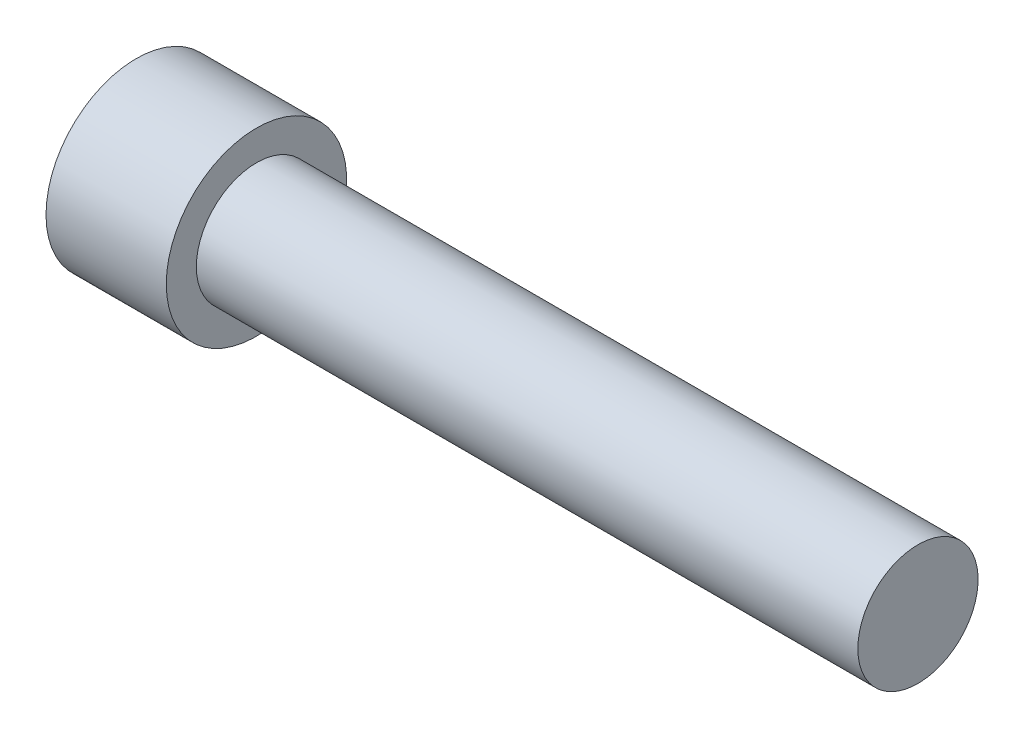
from build123d import *

# Parameters (mm, degrees)
CUT_EXTRUDE1_DEPTH = 3


with BuildPart() as part:
    # Sketch1 → Revolve1 (revolve)
    with BuildSketch(Plane.XY, mode=Mode.PRIVATE) as revolve1_sk:
        Polygon((-31.683838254, -2), (-31.683838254, 1), (-27.683838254, 1), (-27.683838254, 0), (-5.683838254, 0), (-5.683838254, -2), align=None)
    revolve(revolve1_sk.sketch.rotate(Axis((-31.683838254, -2, 0), (1, 0, 0)), 90), axis=Axis((-31.683838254, -2, 0), (1, 0, 0)))

    # Sketch2 → Cut-Extrude1 (cut)
    with BuildSketch(Plane.ZY.offset(31.683838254)):
        Polygon((1.10869247, -0.276718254), (-0.978459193, -0.201528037), (-2.087151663, -1.971459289), (-1.10869247, -3.81658076), (0.978459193, -3.891770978), (2.087151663, -2.121839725), align=None)
    extrude(amount=-CUT_EXTRUDE1_DEPTH, mode=Mode.SUBTRACT)


solid = part.part
